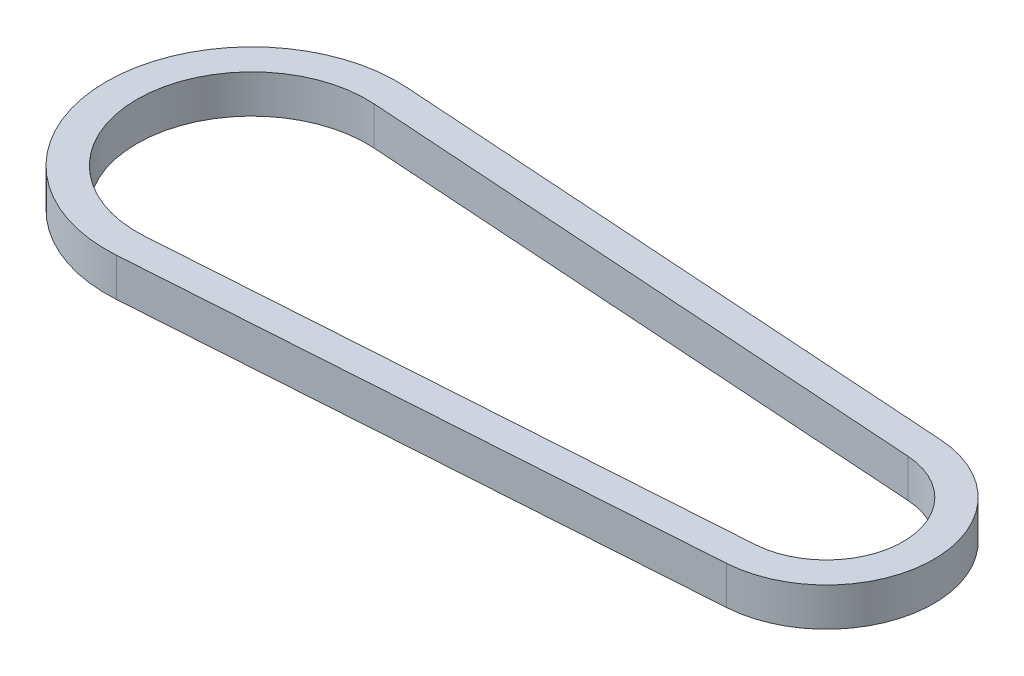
ISO-10303-21;
HEADER;
FILE_DESCRIPTION(('STEP AP214'),'2;1');
FILE_NAME('part.step','',(''),(''),'','','');
FILE_SCHEMA(('AUTOMOTIVE_DESIGN { 1 0 10303 214 1 1 1 1 }'));
ENDSEC;
DATA;
#1=APPLICATION_CONTEXT('core data for automotive mechanical design processes');
#2=APPLICATION_PROTOCOL_DEFINITION('international standard','automotive_design',2000,#1);
#3=PRODUCT_CONTEXT('',#1,'mechanical');
#4=PRODUCT('Part','Part','',(#3));
#5=PRODUCT_RELATED_PRODUCT_CATEGORY('part','',(#4));
#6=PRODUCT_DEFINITION_FORMATION('','',#4);
#7=PRODUCT_DEFINITION_CONTEXT('part definition',#1,'design');
#8=PRODUCT_DEFINITION('design','',#6,#7);
#9=PRODUCT_DEFINITION_SHAPE('','',#8);
#10=(LENGTH_UNIT() NAMED_UNIT(*) SI_UNIT(.MILLI.,.METRE.));
#11=(NAMED_UNIT(*) PLANE_ANGLE_UNIT() SI_UNIT($,.RADIAN.));
#12=(NAMED_UNIT(*) SI_UNIT($,.STERADIAN.) SOLID_ANGLE_UNIT());
#13=UNCERTAINTY_MEASURE_WITH_UNIT(LENGTH_MEASURE(1.E-05),#10,'distance_accuracy_value','');
#14=(GEOMETRIC_REPRESENTATION_CONTEXT(3) GLOBAL_UNCERTAINTY_ASSIGNED_CONTEXT((#13)) GLOBAL_UNIT_ASSIGNED_CONTEXT((#10,
#11,#12)) REPRESENTATION_CONTEXT('',''));
#15=CARTESIAN_POINT('',(0.,0.,0.));
#16=DIRECTION('',(0.,0.,1.));
#17=DIRECTION('',(1.,0.,0.));
#18=AXIS2_PLACEMENT_3D('',#15,#16,#17);
#19=CARTESIAN_POINT('',(0.,10.,0.));
#20=DIRECTION('',(0.,1.,0.));
#21=DIRECTION('',(0.,0.,1.));
#22=AXIS2_PLACEMENT_3D('',#19,#20,#21);
#23=PLANE('',#22);
#24=CARTESIAN_POINT('',(0.,10.,0.));
#25=DIRECTION('',(0.,1.,0.));
#26=DIRECTION('',(0.,0.,1.));
#27=AXIS2_PLACEMENT_3D('',#24,#25,#26);
#28=CIRCLE('',#27,38.);
#29=CARTESIAN_POINT('',(2.53333333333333,10.,-37.9154615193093));
#30=VERTEX_POINT('',#29);
#31=CARTESIAN_POINT('',(2.53333333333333,10.,37.9154615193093));
#32=VERTEX_POINT('',#31);
#33=EDGE_CURVE('E133',#30,#32,#28,.T.);
#34=ORIENTED_EDGE('',*,*,#33,.T.);
#35=DIRECTION('',(0.997775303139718,0.,-0.0666666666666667));
#36=VECTOR('',#35,1.);
#37=CARTESIAN_POINT('',(2.53333333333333,10.,37.9154615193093));
#38=LINE('',#37,#36);
#39=CARTESIAN_POINT('',(151.866666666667,10.,27.9377084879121));
#40=VERTEX_POINT('',#39);
#41=EDGE_CURVE('E136',#32,#40,#38,.T.);
#42=ORIENTED_EDGE('',*,*,#41,.T.);
#43=CARTESIAN_POINT('',(150.,10.,0.));
#44=DIRECTION('',(0.,1.,0.));
#45=DIRECTION('',(0.,0.,1.));
#46=AXIS2_PLACEMENT_3D('',#43,#44,#45);
#47=CIRCLE('',#46,28.);
#48=CARTESIAN_POINT('',(151.866666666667,10.,-27.9377084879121));
#49=VERTEX_POINT('',#48);
#50=EDGE_CURVE('E139',#40,#49,#47,.T.);
#51=ORIENTED_EDGE('',*,*,#50,.T.);
#52=DIRECTION('',(-0.997775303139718,0.,-0.0666666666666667));
#53=VECTOR('',#52,1.);
#54=CARTESIAN_POINT('',(2.53333333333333,10.,-37.9154615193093));
#55=LINE('',#54,#53);
#56=EDGE_CURVE('E141',#49,#30,#55,.T.);
#57=ORIENTED_EDGE('',*,*,#56,.T.);
#58=EDGE_LOOP('',(#34,#42,#51,#57));
#59=FACE_BOUND('',#58,.T.);
#60=DIRECTION('',(0.997775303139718,0.,-0.0666666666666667));
#61=VECTOR('',#60,1.);
#62=CARTESIAN_POINT('',(2.,10.,29.9332590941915));
#63=LINE('',#62,#61);
#64=CARTESIAN_POINT('',(2.,10.,29.9332590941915));
#65=VERTEX_POINT('',#64);
#66=CARTESIAN_POINT('',(151.333333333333,10.,19.9555060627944));
#67=VERTEX_POINT('',#66);
#68=EDGE_CURVE('E105',#65,#67,#63,.T.);
#69=ORIENTED_EDGE('',*,*,#68,.F.);
#70=CARTESIAN_POINT('',(0.,10.,0.));
#71=DIRECTION('',(0.,1.,0.));
#72=DIRECTION('',(0.,0.,1.));
#73=AXIS2_PLACEMENT_3D('',#70,#71,#72);
#74=CIRCLE('',#73,30.);
#75=CARTESIAN_POINT('',(2.,10.,-29.9332590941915));
#76=VERTEX_POINT('',#75);
#77=EDGE_CURVE('E97',#76,#65,#74,.T.);
#78=ORIENTED_EDGE('',*,*,#77,.F.);
#79=DIRECTION('',(-0.997775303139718,0.,-0.0666666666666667));
#80=VECTOR('',#79,1.);
#81=CARTESIAN_POINT('',(2.,10.,-29.9332590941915));
#82=LINE('',#81,#80);
#83=CARTESIAN_POINT('',(151.333333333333,10.,-19.9555060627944));
#84=VERTEX_POINT('',#83);
#85=EDGE_CURVE('E119',#84,#76,#82,.T.);
#86=ORIENTED_EDGE('',*,*,#85,.F.);
#87=CARTESIAN_POINT('',(150.,10.,0.));
#88=DIRECTION('',(0.,1.,0.));
#89=DIRECTION('',(0.,0.,1.));
#90=AXIS2_PLACEMENT_3D('',#87,#88,#89);
#91=CIRCLE('',#90,20.);
#92=EDGE_CURVE('E117',#67,#84,#91,.T.);
#93=ORIENTED_EDGE('',*,*,#92,.F.);
#94=EDGE_LOOP('',(#69,#78,#86,#93));
#95=FACE_BOUND('',#94,.T.);
#96=ADVANCED_FACE('F32',(#59,#95),#23,.T.);
#97=CARTESIAN_POINT('',(0.,0.,0.));
#98=DIRECTION('',(0.,1.,0.));
#99=DIRECTION('',(0.,0.,1.));
#100=AXIS2_PLACEMENT_3D('',#97,#98,#99);
#101=PLANE('',#100);
#102=CARTESIAN_POINT('',(0.,0.,0.));
#103=DIRECTION('',(0.,1.,0.));
#104=DIRECTION('',(0.,0.,1.));
#105=AXIS2_PLACEMENT_3D('',#102,#103,#104);
#106=CIRCLE('',#105,38.);
#107=CARTESIAN_POINT('',(2.53333333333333,0.,-37.9154615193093));
#108=VERTEX_POINT('',#107);
#109=CARTESIAN_POINT('',(2.53333333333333,0.,37.9154615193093));
#110=VERTEX_POINT('',#109);
#111=EDGE_CURVE('E113',#108,#110,#106,.T.);
#112=ORIENTED_EDGE('',*,*,#111,.F.);
#113=DIRECTION('',(-0.997775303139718,0.,-0.0666666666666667));
#114=VECTOR('',#113,1.);
#115=CARTESIAN_POINT('',(2.53333333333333,0.,-37.9154615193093));
#116=LINE('',#115,#114);
#117=CARTESIAN_POINT('',(151.866666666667,0.,-27.9377084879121));
#118=VERTEX_POINT('',#117);
#119=EDGE_CURVE('E137',#118,#108,#116,.T.);
#120=ORIENTED_EDGE('',*,*,#119,.F.);
#121=CARTESIAN_POINT('',(150.,0.,0.));
#122=DIRECTION('',(0.,1.,0.));
#123=DIRECTION('',(0.,0.,1.));
#124=AXIS2_PLACEMENT_3D('',#121,#122,#123);
#125=CIRCLE('',#124,28.);
#126=CARTESIAN_POINT('',(151.866666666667,0.,27.9377084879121));
#127=VERTEX_POINT('',#126);
#128=EDGE_CURVE('E148',#127,#118,#125,.T.);
#129=ORIENTED_EDGE('',*,*,#128,.F.);
#130=DIRECTION('',(0.997775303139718,0.,-0.0666666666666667));
#131=VECTOR('',#130,1.);
#132=CARTESIAN_POINT('',(2.53333333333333,0.,37.9154615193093));
#133=LINE('',#132,#131);
#134=EDGE_CURVE('E146',#110,#127,#133,.T.);
#135=ORIENTED_EDGE('',*,*,#134,.F.);
#136=EDGE_LOOP('',(#112,#120,#129,#135));
#137=FACE_BOUND('',#136,.T.);
#138=CARTESIAN_POINT('',(0.,0.,0.));
#139=DIRECTION('',(0.,1.,0.));
#140=DIRECTION('',(0.,0.,1.));
#141=AXIS2_PLACEMENT_3D('',#138,#139,#140);
#142=CIRCLE('',#141,30.);
#143=CARTESIAN_POINT('',(2.,0.,-29.9332590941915));
#144=VERTEX_POINT('',#143);
#145=CARTESIAN_POINT('',(2.,0.,29.9332590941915));
#146=VERTEX_POINT('',#145);
#147=EDGE_CURVE('E55',#144,#146,#142,.T.);
#148=ORIENTED_EDGE('',*,*,#147,.T.);
#149=DIRECTION('',(0.997775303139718,0.,-0.0666666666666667));
#150=VECTOR('',#149,1.);
#151=CARTESIAN_POINT('',(2.,0.,29.9332590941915));
#152=LINE('',#151,#150);
#153=CARTESIAN_POINT('',(151.333333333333,0.,19.9555060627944));
#154=VERTEX_POINT('',#153);
#155=EDGE_CURVE('E112',#146,#154,#152,.T.);
#156=ORIENTED_EDGE('',*,*,#155,.T.);
#157=CARTESIAN_POINT('',(150.,0.,0.));
#158=DIRECTION('',(0.,1.,0.));
#159=DIRECTION('',(0.,0.,1.));
#160=AXIS2_PLACEMENT_3D('',#157,#158,#159);
#161=CIRCLE('',#160,20.);
#162=CARTESIAN_POINT('',(151.333333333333,0.,-19.9555060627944));
#163=VERTEX_POINT('',#162);
#164=EDGE_CURVE('E125',#154,#163,#161,.T.);
#165=ORIENTED_EDGE('',*,*,#164,.T.);
#166=DIRECTION('',(-0.997775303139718,0.,-0.0666666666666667));
#167=VECTOR('',#166,1.);
#168=CARTESIAN_POINT('',(2.,0.,-29.9332590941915));
#169=LINE('',#168,#167);
#170=EDGE_CURVE('E106',#163,#144,#169,.T.);
#171=ORIENTED_EDGE('',*,*,#170,.T.);
#172=EDGE_LOOP('',(#148,#156,#165,#171));
#173=FACE_BOUND('',#172,.T.);
#174=ADVANCED_FACE('F166',(#137,#173),#101,.F.);
#175=CARTESIAN_POINT('',(0.,10.,0.));
#176=DIRECTION('',(0.,-1.,0.));
#177=DIRECTION('',(0.,0.,-1.));
#178=AXIS2_PLACEMENT_3D('',#175,#176,#177);
#179=CYLINDRICAL_SURFACE('',#178,38.);
#180=ORIENTED_EDGE('',*,*,#111,.T.);
#181=DIRECTION('',(0.,-1.,0.));
#182=VECTOR('',#181,1.);
#183=CARTESIAN_POINT('',(2.53333333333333,10.,37.9154615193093));
#184=LINE('',#183,#182);
#185=EDGE_CURVE('E11',#32,#110,#184,.T.);
#186=ORIENTED_EDGE('',*,*,#185,.F.);
#187=ORIENTED_EDGE('',*,*,#33,.F.);
#188=DIRECTION('',(0.,-1.,0.));
#189=VECTOR('',#188,1.);
#190=CARTESIAN_POINT('',(2.53333333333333,10.,-37.9154615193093));
#191=LINE('',#190,#189);
#192=EDGE_CURVE('E143',#30,#108,#191,.T.);
#193=ORIENTED_EDGE('',*,*,#192,.T.);
#194=EDGE_LOOP('',(#180,#186,#187,#193));
#195=FACE_BOUND('',#194,.T.);
#196=ADVANCED_FACE('F34',(#195),#179,.T.);
#197=CARTESIAN_POINT('',(2.53333333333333,10.,37.9154615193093));
#198=DIRECTION('',(-0.0666666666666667,0.,-0.997775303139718));
#199=DIRECTION('',(-0.997775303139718,0.,0.0666666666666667));
#200=AXIS2_PLACEMENT_3D('',#197,#198,#199);
#201=PLANE('',#200);
#202=ORIENTED_EDGE('',*,*,#134,.T.);
#203=DIRECTION('',(0.,-1.,0.));
#204=VECTOR('',#203,1.);
#205=CARTESIAN_POINT('',(151.866666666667,10.,27.9377084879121));
#206=LINE('',#205,#204);
#207=EDGE_CURVE('E40',#40,#127,#206,.T.);
#208=ORIENTED_EDGE('',*,*,#207,.F.);
#209=ORIENTED_EDGE('',*,*,#41,.F.);
#210=ORIENTED_EDGE('',*,*,#185,.T.);
#211=EDGE_LOOP('',(#202,#208,#209,#210));
#212=FACE_BOUND('',#211,.T.);
#213=ADVANCED_FACE('F176',(#212),#201,.F.);
#214=CARTESIAN_POINT('',(150.,10.,0.));
#215=DIRECTION('',(0.,-1.,0.));
#216=DIRECTION('',(0.,0.,-1.));
#217=AXIS2_PLACEMENT_3D('',#214,#215,#216);
#218=CYLINDRICAL_SURFACE('',#217,28.);
#219=ORIENTED_EDGE('',*,*,#128,.T.);
#220=DIRECTION('',(0.,-1.,0.));
#221=VECTOR('',#220,1.);
#222=CARTESIAN_POINT('',(151.866666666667,10.,-27.9377084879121));
#223=LINE('',#222,#221);
#224=EDGE_CURVE('E153',#49,#118,#223,.T.);
#225=ORIENTED_EDGE('',*,*,#224,.F.);
#226=ORIENTED_EDGE('',*,*,#50,.F.);
#227=ORIENTED_EDGE('',*,*,#207,.T.);
#228=EDGE_LOOP('',(#219,#225,#226,#227));
#229=FACE_BOUND('',#228,.T.);
#230=ADVANCED_FACE('F160',(#229),#218,.T.);
#231=CARTESIAN_POINT('',(2.53333333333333,10.,-37.9154615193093));
#232=DIRECTION('',(-0.0666666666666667,0.,0.997775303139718));
#233=DIRECTION('',(0.997775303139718,0.,0.0666666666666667));
#234=AXIS2_PLACEMENT_3D('',#231,#232,#233);
#235=PLANE('',#234);
#236=ORIENTED_EDGE('',*,*,#119,.T.);
#237=ORIENTED_EDGE('',*,*,#192,.F.);
#238=ORIENTED_EDGE('',*,*,#56,.F.);
#239=ORIENTED_EDGE('',*,*,#224,.T.);
#240=EDGE_LOOP('',(#236,#237,#238,#239));
#241=FACE_BOUND('',#240,.T.);
#242=ADVANCED_FACE('F170',(#241),#235,.F.);
#243=CARTESIAN_POINT('',(0.,10.,0.));
#244=DIRECTION('',(0.,-1.,0.));
#245=DIRECTION('',(0.,0.,-1.));
#246=AXIS2_PLACEMENT_3D('',#243,#244,#245);
#247=CYLINDRICAL_SURFACE('',#246,30.);
#248=ORIENTED_EDGE('',*,*,#147,.F.);
#249=DIRECTION('',(0.,-1.,0.));
#250=VECTOR('',#249,1.);
#251=CARTESIAN_POINT('',(2.,10.,-29.9332590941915));
#252=LINE('',#251,#250);
#253=EDGE_CURVE('E101',#76,#144,#252,.T.);
#254=ORIENTED_EDGE('',*,*,#253,.F.);
#255=ORIENTED_EDGE('',*,*,#77,.T.);
#256=DIRECTION('',(0.,-1.,0.));
#257=VECTOR('',#256,1.);
#258=CARTESIAN_POINT('',(2.,10.,29.9332590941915));
#259=LINE('',#258,#257);
#260=EDGE_CURVE('E100',#65,#146,#259,.T.);
#261=ORIENTED_EDGE('',*,*,#260,.T.);
#262=EDGE_LOOP('',(#248,#254,#255,#261));
#263=FACE_BOUND('',#262,.T.);
#264=ADVANCED_FACE('F99',(#263),#247,.F.);
#265=CARTESIAN_POINT('',(2.,10.,29.9332590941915));
#266=DIRECTION('',(-0.0666666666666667,0.,-0.997775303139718));
#267=DIRECTION('',(-0.997775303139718,0.,0.0666666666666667));
#268=AXIS2_PLACEMENT_3D('',#265,#266,#267);
#269=PLANE('',#268);
#270=ORIENTED_EDGE('',*,*,#155,.F.);
#271=ORIENTED_EDGE('',*,*,#260,.F.);
#272=ORIENTED_EDGE('',*,*,#68,.T.);
#273=DIRECTION('',(0.,-1.,0.));
#274=VECTOR('',#273,1.);
#275=CARTESIAN_POINT('',(151.333333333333,10.,19.9555060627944));
#276=LINE('',#275,#274);
#277=EDGE_CURVE('E114',#67,#154,#276,.T.);
#278=ORIENTED_EDGE('',*,*,#277,.T.);
#279=EDGE_LOOP('',(#270,#271,#272,#278));
#280=FACE_BOUND('',#279,.T.);
#281=ADVANCED_FACE('F109',(#280),#269,.T.);
#282=CARTESIAN_POINT('',(150.,10.,0.));
#283=DIRECTION('',(0.,-1.,0.));
#284=DIRECTION('',(0.,0.,-1.));
#285=AXIS2_PLACEMENT_3D('',#282,#283,#284);
#286=CYLINDRICAL_SURFACE('',#285,20.);
#287=ORIENTED_EDGE('',*,*,#164,.F.);
#288=ORIENTED_EDGE('',*,*,#277,.F.);
#289=ORIENTED_EDGE('',*,*,#92,.T.);
#290=DIRECTION('',(0.,-1.,0.));
#291=VECTOR('',#290,1.);
#292=CARTESIAN_POINT('',(151.333333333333,10.,-19.9555060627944));
#293=LINE('',#292,#291);
#294=EDGE_CURVE('E47',#84,#163,#293,.T.);
#295=ORIENTED_EDGE('',*,*,#294,.T.);
#296=EDGE_LOOP('',(#287,#288,#289,#295));
#297=FACE_BOUND('',#296,.T.);
#298=ADVANCED_FACE('F199',(#297),#286,.F.);
#299=CARTESIAN_POINT('',(2.,10.,-29.9332590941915));
#300=DIRECTION('',(-0.0666666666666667,0.,0.997775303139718));
#301=DIRECTION('',(0.997775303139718,0.,0.0666666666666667));
#302=AXIS2_PLACEMENT_3D('',#299,#300,#301);
#303=PLANE('',#302);
#304=ORIENTED_EDGE('',*,*,#170,.F.);
#305=ORIENTED_EDGE('',*,*,#294,.F.);
#306=ORIENTED_EDGE('',*,*,#85,.T.);
#307=ORIENTED_EDGE('',*,*,#253,.T.);
#308=EDGE_LOOP('',(#304,#305,#306,#307));
#309=FACE_BOUND('',#308,.T.);
#310=ADVANCED_FACE('F203',(#309),#303,.T.);
#311=CLOSED_SHELL('',(#96,#174,#196,#213,#230,#242,#264,#281,#298,#310));
#312=MANIFOLD_SOLID_BREP('B2',#311);
#313=ADVANCED_BREP_SHAPE_REPRESENTATION('',(#18,#312),#14);
#314=SHAPE_DEFINITION_REPRESENTATION(#9,#313);
ENDSEC;
END-ISO-10303-21;
